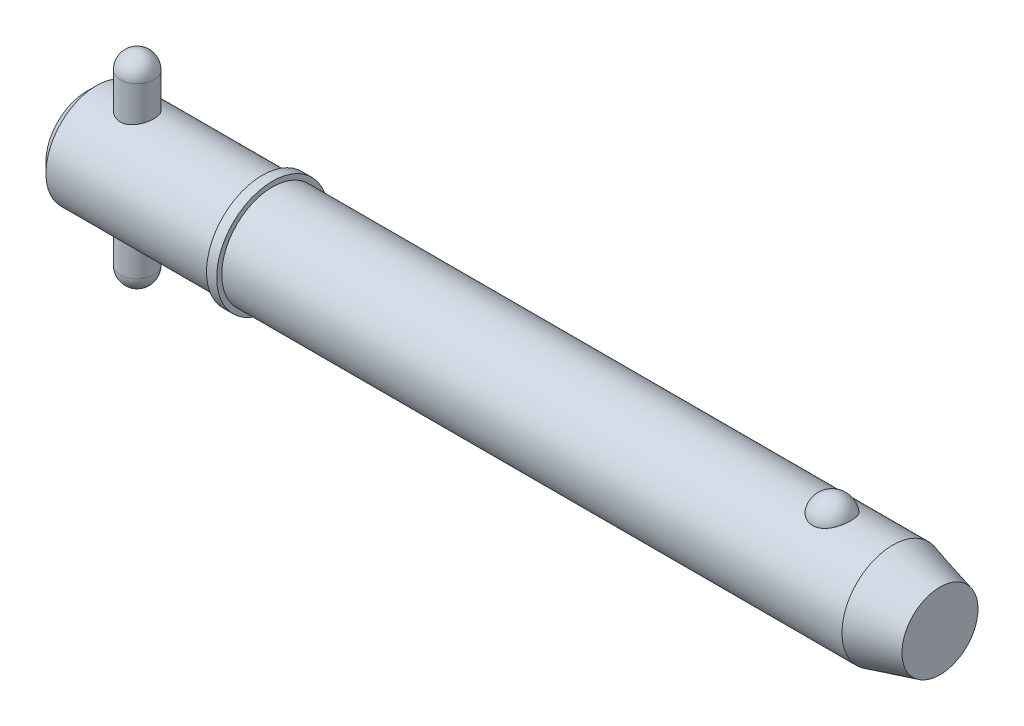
ISO-10303-21;
HEADER;
FILE_DESCRIPTION(('STEP AP214'),'2;1');
FILE_NAME('part.step','',(''),(''),'','','');
FILE_SCHEMA(('AUTOMOTIVE_DESIGN { 1 0 10303 214 1 1 1 1 }'));
ENDSEC;
DATA;
#1=APPLICATION_CONTEXT('core data for automotive mechanical design processes');
#2=APPLICATION_PROTOCOL_DEFINITION('international standard','automotive_design',2000,#1);
#3=PRODUCT_CONTEXT('',#1,'mechanical');
#4=PRODUCT('Part','Part','',(#3));
#5=PRODUCT_RELATED_PRODUCT_CATEGORY('part','',(#4));
#6=PRODUCT_DEFINITION_FORMATION('','',#4);
#7=PRODUCT_DEFINITION_CONTEXT('part definition',#1,'design');
#8=PRODUCT_DEFINITION('design','',#6,#7);
#9=PRODUCT_DEFINITION_SHAPE('','',#8);
#10=(LENGTH_UNIT() NAMED_UNIT(*) SI_UNIT(.MILLI.,.METRE.));
#11=(NAMED_UNIT(*) PLANE_ANGLE_UNIT() SI_UNIT($,.RADIAN.));
#12=(NAMED_UNIT(*) SI_UNIT($,.STERADIAN.) SOLID_ANGLE_UNIT());
#13=UNCERTAINTY_MEASURE_WITH_UNIT(LENGTH_MEASURE(1.E-05),#10,'distance_accuracy_value','');
#14=(GEOMETRIC_REPRESENTATION_CONTEXT(3) GLOBAL_UNCERTAINTY_ASSIGNED_CONTEXT((#13)) GLOBAL_UNIT_ASSIGNED_CONTEXT((#10,
#11,#12)) REPRESENTATION_CONTEXT('',''));
#15=CARTESIAN_POINT('',(0.,0.,0.));
#16=DIRECTION('',(0.,0.,1.));
#17=DIRECTION('',(1.,0.,0.));
#18=AXIS2_PLACEMENT_3D('',#15,#16,#17);
#19=CARTESIAN_POINT('',(9.525,19.05,0.));
#20=DIRECTION('',(0.,-1.,0.));
#21=DIRECTION('',(0.,0.,-1.));
#22=AXIS2_PLACEMENT_3D('',#19,#20,#21);
#23=CYLINDRICAL_SURFACE('',#22,3.175);
#24=CARTESIAN_POINT('',(9.525,-15.875,0.));
#25=DIRECTION('',(0.,-1.,0.));
#26=DIRECTION('',(0.,0.,-1.));
#27=AXIS2_PLACEMENT_3D('',#24,#25,#26);
#28=CIRCLE('',#27,3.175);
#29=CARTESIAN_POINT('',(9.525,-15.875,-3.175));
#30=VERTEX_POINT('',#29);
#31=EDGE_CURVE('P0_E10',#30,#30,#28,.F.);
#32=CARTESIAN_POINT('',(9.525,15.875,0.));
#33=DIRECTION('',(0.,-1.,0.));
#34=DIRECTION('',(0.,0.,-1.));
#35=AXIS2_PLACEMENT_3D('',#32,#33,#34);
#36=CIRCLE('',#35,3.175);
#37=CARTESIAN_POINT('',(9.525,15.875,-3.175));
#38=VERTEX_POINT('',#37);
#39=EDGE_CURVE('P0_E21',#38,#38,#36,.T.);
#40=CARTESIAN_POINT('',(9.525,-15.875,-3.175));
#41=CARTESIAN_POINT('',(9.525,-15.5442708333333,-3.175));
#42=CARTESIAN_POINT('',(9.525,-15.2135416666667,-3.175));
#43=CARTESIAN_POINT('',(9.525,-14.5520833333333,-3.175));
#44=CARTESIAN_POINT('',(9.525,-14.2213541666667,-3.175));
#45=CARTESIAN_POINT('',(9.525,-13.5598958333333,-3.175));
#46=CARTESIAN_POINT('',(9.525,-13.2291666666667,-3.175));
#47=CARTESIAN_POINT('',(9.525,-12.5677083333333,-3.175));
#48=CARTESIAN_POINT('',(9.525,-12.2369791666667,-3.175));
#49=CARTESIAN_POINT('',(9.525,-11.5755208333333,-3.175));
#50=CARTESIAN_POINT('',(9.525,-11.2447916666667,-3.175));
#51=CARTESIAN_POINT('',(9.525,-10.5833333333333,-3.175));
#52=CARTESIAN_POINT('',(9.525,-10.2526041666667,-3.175));
#53=CARTESIAN_POINT('',(9.525,-9.59114583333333,-3.175));
#54=CARTESIAN_POINT('',(9.525,-9.26041666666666,-3.175));
#55=CARTESIAN_POINT('',(9.525,-8.59895833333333,-3.175));
#56=CARTESIAN_POINT('',(9.525,-8.26822916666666,-3.175));
#57=CARTESIAN_POINT('',(9.525,-7.60677083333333,-3.175));
#58=CARTESIAN_POINT('',(9.525,-7.27604166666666,-3.175));
#59=CARTESIAN_POINT('',(9.525,-6.61458333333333,-3.175));
#60=CARTESIAN_POINT('',(9.525,-6.28385416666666,-3.175));
#61=CARTESIAN_POINT('',(9.525,-5.62239583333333,-3.175));
#62=CARTESIAN_POINT('',(9.525,-5.29166666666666,-3.175));
#63=CARTESIAN_POINT('',(9.525,-4.63020833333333,-3.175));
#64=CARTESIAN_POINT('',(9.525,-4.29947916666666,-3.175));
#65=CARTESIAN_POINT('',(9.525,-3.63802083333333,-3.175));
#66=CARTESIAN_POINT('',(9.525,-3.30729166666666,-3.175));
#67=CARTESIAN_POINT('',(9.525,-2.64583333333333,-3.175));
#68=CARTESIAN_POINT('',(9.525,-2.31510416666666,-3.175));
#69=CARTESIAN_POINT('',(9.525,-1.65364583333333,-3.175));
#70=CARTESIAN_POINT('',(9.525,-1.32291666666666,-3.175));
#71=CARTESIAN_POINT('',(9.525,-0.661458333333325,-3.175));
#72=CARTESIAN_POINT('',(9.525,-0.330729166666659,-3.175));
#73=CARTESIAN_POINT('',(9.525,0.330729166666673,-3.175));
#74=CARTESIAN_POINT('',(9.525,0.661458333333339,-3.175));
#75=CARTESIAN_POINT('',(9.525,1.32291666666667,-3.175));
#76=CARTESIAN_POINT('',(9.525,1.65364583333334,-3.175));
#77=CARTESIAN_POINT('',(9.525,2.31510416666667,-3.175));
#78=CARTESIAN_POINT('',(9.525,2.64583333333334,-3.175));
#79=CARTESIAN_POINT('',(9.525,3.30729166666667,-3.175));
#80=CARTESIAN_POINT('',(9.525,3.63802083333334,-3.175));
#81=CARTESIAN_POINT('',(9.525,4.29947916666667,-3.175));
#82=CARTESIAN_POINT('',(9.525,4.63020833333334,-3.175));
#83=CARTESIAN_POINT('',(9.525,5.29166666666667,-3.175));
#84=CARTESIAN_POINT('',(9.525,5.62239583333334,-3.175));
#85=CARTESIAN_POINT('',(9.525,6.28385416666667,-3.175));
#86=CARTESIAN_POINT('',(9.525,6.61458333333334,-3.175));
#87=CARTESIAN_POINT('',(9.525,7.27604166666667,-3.175));
#88=CARTESIAN_POINT('',(9.525,7.60677083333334,-3.175));
#89=CARTESIAN_POINT('',(9.525,8.26822916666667,-3.175));
#90=CARTESIAN_POINT('',(9.525,8.59895833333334,-3.175));
#91=CARTESIAN_POINT('',(9.525,9.26041666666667,-3.175));
#92=CARTESIAN_POINT('',(9.525,9.59114583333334,-3.175));
#93=CARTESIAN_POINT('',(9.525,10.2526041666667,-3.175));
#94=CARTESIAN_POINT('',(9.525,10.5833333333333,-3.175));
#95=CARTESIAN_POINT('',(9.525,11.2447916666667,-3.175));
#96=CARTESIAN_POINT('',(9.525,11.5755208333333,-3.175));
#97=CARTESIAN_POINT('',(9.525,12.2369791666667,-3.175));
#98=CARTESIAN_POINT('',(9.525,12.5677083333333,-3.175));
#99=CARTESIAN_POINT('',(9.525,13.2291666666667,-3.175));
#100=CARTESIAN_POINT('',(9.525,13.5598958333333,-3.175));
#101=CARTESIAN_POINT('',(9.525,14.2213541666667,-3.175));
#102=CARTESIAN_POINT('',(9.525,14.5520833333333,-3.175));
#103=CARTESIAN_POINT('',(9.525,15.2135416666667,-3.175));
#104=CARTESIAN_POINT('',(9.525,15.5442708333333,-3.175));
#105=CARTESIAN_POINT('',(9.525,15.875,-3.175));
#106=B_SPLINE_CURVE_WITH_KNOTS('',3,(#40,#41,#42,#43,#44,#45,#46,#47,#48,#49,#50,#51,#52,#53,
#54,#55,#56,#57,#58,#59,#60,#61,#62,#63,#64,#65,#66,#67,#68,#69,#70,#71,#72,#73,#74,#75,#76,#77,
#78,#79,#80,#81,#82,#83,#84,#85,#86,#87,#88,#89,#90,#91,#92,#93,#94,#95,#96,#97,#98,#99,#100,
#101,#102,#103,#104,#105),.UNSPECIFIED.,.F.,.F.,(4,2,2,2,2,2,2,2,2,2,2,2,2,2,2,2,2,2,2,2,2,2,2,
2,2,2,2,2,2,2,2,2,4),(0.,0.992187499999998,1.984375,2.9765625,3.96875,4.96093749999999,5.953125,
6.9453125,7.9375,8.92968749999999,9.921875,10.9140625,11.90625,12.8984375,13.890625,14.8828125,
15.875,16.8671875,17.859375,18.8515625,19.84375,20.8359375,21.828125,22.8203125,23.8125,
24.8046875,25.796875,26.7890625,27.78125,28.7734375,29.765625,30.7578125,31.75),.UNSPECIFIED.);
#107=EDGE_CURVE('P0_BSEAM14',#30,#38,#106,.T.);
#108=ORIENTED_EDGE('',*,*,#31,.T.);
#109=ORIENTED_EDGE('',*,*,#39,.T.);
#110=ORIENTED_EDGE('',*,*,#107,.T.);
#111=ORIENTED_EDGE('',*,*,#107,.F.);
#112=EDGE_LOOP('',(#108,#110,#109,#111));
#113=FACE_BOUND('',#112,.T.);
#114=ADVANCED_FACE('P0_F14',(#113),#23,.T.);
#115=CARTESIAN_POINT('',(9.525,-15.875,0.));
#116=DIRECTION('',(0.,0.,1.));
#117=DIRECTION('',(1.,0.,0.));
#118=AXIS2_PLACEMENT_3D('',#115,#116,#117);
#119=SPHERICAL_SURFACE('',#118,3.175);
#120=CARTESIAN_POINT('',(9.525,-15.875,0.));
#121=DIRECTION('',(0.,-1.,0.));
#122=DIRECTION('',(0.,0.,-1.));
#123=AXIS2_PLACEMENT_3D('',#120,#121,#122);
#124=SPHERICAL_SURFACE('',#123,3.175);
#125=ORIENTED_EDGE('',*,*,#31,.F.);
#126=EDGE_LOOP('',(#125));
#127=FACE_BOUND('',#126,.T.);
#128=ADVANCED_FACE('P0_F29',(#127),#124,.T.);
#129=CARTESIAN_POINT('',(9.525,15.875,0.));
#130=DIRECTION('',(0.,0.,1.));
#131=DIRECTION('',(1.,0.,0.));
#132=AXIS2_PLACEMENT_3D('',#129,#130,#131);
#133=SPHERICAL_SURFACE('',#132,3.175);
#134=CARTESIAN_POINT('',(9.525,15.875,0.));
#135=DIRECTION('',(0.,-1.,0.));
#136=DIRECTION('',(0.,0.,-1.));
#137=AXIS2_PLACEMENT_3D('',#134,#135,#136);
#138=SPHERICAL_SURFACE('',#137,3.175);
#139=ORIENTED_EDGE('',*,*,#39,.F.);
#140=EDGE_LOOP('',(#139));
#141=FACE_BOUND('',#140,.T.);
#142=ADVANCED_FACE('P0_F16',(#141),#138,.T.);
#143=CLOSED_SHELL('',(#114,#128,#142));
#144=MANIFOLD_SOLID_BREP('P0_B1',#143);
#145=CARTESIAN_POINT('',(0.,0.,0.));
#146=DIRECTION('',(1.,0.,0.));
#147=DIRECTION('',(0.,0.,-1.));
#148=AXIS2_PLACEMENT_3D('',#145,#146,#147);
#149=CYLINDRICAL_SURFACE('',#148,9.525);
#150=CARTESIAN_POINT('',(151.443054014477,0.,0.));
#151=DIRECTION('',(1.,0.,0.));
#152=DIRECTION('',(0.,0.,-1.));
#153=AXIS2_PLACEMENT_3D('',#150,#151,#152);
#154=CIRCLE('',#153,9.525);
#155=CARTESIAN_POINT('',(151.443054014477,0.,-9.525));
#156=VERTEX_POINT('',#155);
#157=EDGE_CURVE('P1_E81',#156,#156,#154,.T.);
#158=ORIENTED_EDGE('',*,*,#157,.F.);
#159=EDGE_LOOP('',(#158));
#160=FACE_BOUND('',#159,.T.);
#161=CARTESIAN_POINT('',(34.93,0.,0.));
#162=DIRECTION('',(1.,0.,0.));
#163=DIRECTION('',(0.,0.,-1.));
#164=AXIS2_PLACEMENT_3D('',#161,#162,#163);
#165=CIRCLE('',#164,9.525);
#166=CARTESIAN_POINT('',(34.93,0.,-9.525));
#167=VERTEX_POINT('',#166);
#168=EDGE_CURVE('P1_E85',#167,#167,#165,.T.);
#169=ORIENTED_EDGE('',*,*,#168,.T.);
#170=EDGE_LOOP('',(#169));
#171=FACE_BOUND('',#170,.T.);
#172=CARTESIAN_POINT('',(140.045757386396,8.80405803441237,3.63513233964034));
#173=CARTESIAN_POINT('',(139.951676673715,8.80405953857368,3.63513053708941));
#174=CARTESIAN_POINT('',(139.857561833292,8.80561325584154,3.63137461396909));
#175=CARTESIAN_POINT('',(139.670012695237,8.81177748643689,3.61638665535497));
#176=CARTESIAN_POINT('',(139.576578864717,8.81638992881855,3.60514990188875));
#177=CARTESIAN_POINT('',(139.297945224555,8.83467114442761,3.56024627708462));
#178=CARTESIAN_POINT('',(139.114691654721,8.85278327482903,3.51538626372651));
#179=CARTESIAN_POINT('',(138.759509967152,8.89871214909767,3.39742145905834));
#180=CARTESIAN_POINT('',(138.587553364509,8.92650327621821,3.32439116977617));
#181=CARTESIAN_POINT('',(138.258707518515,8.98874819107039,3.15220244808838));
#182=CARTESIAN_POINT('',(138.101811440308,9.02319893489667,3.05305594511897));
#183=CARTESIAN_POINT('',(137.802214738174,9.09629186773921,2.82797815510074));
#184=CARTESIAN_POINT('',(137.660060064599,9.13502685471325,2.70135138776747));
#185=CARTESIAN_POINT('',(137.398299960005,9.21186572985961,2.42641932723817));
#186=CARTESIAN_POINT('',(137.278701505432,9.24996941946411,2.2781073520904));
#187=CARTESIAN_POINT('',(137.059645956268,9.32341082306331,1.95652290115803));
#188=CARTESIAN_POINT('',(136.961317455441,9.35855090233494,1.78243511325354));
#189=CARTESIAN_POINT('',(136.793819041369,9.42045142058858,1.41937246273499));
#190=CARTESIAN_POINT('',(136.724651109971,9.44721128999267,1.23039658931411));
#191=CARTESIAN_POINT('',(136.616199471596,9.48990641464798,0.84037088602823));
#192=CARTESIAN_POINT('',(136.577288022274,9.50570658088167,0.639202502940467));
#193=CARTESIAN_POINT('',(136.531555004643,9.52433146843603,0.232664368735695));
#194=CARTESIAN_POINT('',(136.524732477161,9.52715657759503,0.0272947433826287));
#195=CARTESIAN_POINT('',(136.543255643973,9.51956918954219,-0.380478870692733));
#196=CARTESIAN_POINT('',(136.568405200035,9.50923740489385,-0.582893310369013));
#197=CARTESIAN_POINT('',(136.65002537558,9.47651897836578,-0.98029399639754));
#198=CARTESIAN_POINT('',(136.706496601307,9.45413210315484,-1.17528009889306));
#199=CARTESIAN_POINT('',(136.849719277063,9.39954044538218,-1.55263697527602));
#200=CARTESIAN_POINT('',(136.936512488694,9.36732213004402,-1.73498993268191));
#201=CARTESIAN_POINT('',(137.138610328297,9.29640700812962,-2.08177763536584));
#202=CARTESIAN_POINT('',(137.253917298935,9.25770966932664,-2.24621090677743));
#203=CARTESIAN_POINT('',(137.511264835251,9.17775604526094,-2.5533833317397));
#204=CARTESIAN_POINT('',(137.653434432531,9.136488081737,-2.696011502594));
#205=CARTESIAN_POINT('',(137.96089985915,9.05620497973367,-2.95451229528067));
#206=CARTESIAN_POINT('',(138.126193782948,9.01718965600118,-3.07038711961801));
#207=CARTESIAN_POINT('',(138.472052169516,8.94680019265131,-3.26976836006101));
#208=CARTESIAN_POINT('',(138.652227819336,8.91528408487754,-3.35389750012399));
#209=CARTESIAN_POINT('',(139.025651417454,8.86272514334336,-3.49043503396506));
#210=CARTESIAN_POINT('',(139.218894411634,8.84167836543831,-3.54285537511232));
#211=CARTESIAN_POINT('',(139.602503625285,8.81348056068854,-3.61241306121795));
#212=CARTESIAN_POINT('',(139.792525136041,8.80568348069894,-3.6311933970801));
#213=CARTESIAN_POINT('',(140.173190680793,8.80289410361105,-3.63795342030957));
#214=CARTESIAN_POINT('',(140.363834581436,8.80789922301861,-3.62593932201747));
#215=CARTESIAN_POINT('',(140.734007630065,8.82974915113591,-3.57238430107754));
#216=CARTESIAN_POINT('',(140.913697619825,8.84621463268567,-3.53178890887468));
#217=CARTESIAN_POINT('',(141.263422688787,8.88875330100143,-3.42331083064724));
#218=CARTESIAN_POINT('',(141.433456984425,8.91482726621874,-3.35542593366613));
#219=CARTESIAN_POINT('',(141.763237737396,8.97448239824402,-3.19248225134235));
#220=CARTESIAN_POINT('',(141.922680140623,9.00821446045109,-3.0968647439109));
#221=CARTESIAN_POINT('',(142.223513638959,9.07935398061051,-2.88162736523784));
#222=CARTESIAN_POINT('',(142.364900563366,9.11676228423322,-2.76200196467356));
#223=CARTESIAN_POINT('',(142.63331931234,9.19347419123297,-2.49516285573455));
#224=CARTESIAN_POINT('',(142.759275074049,9.23277872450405,-2.34686614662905));
#225=CARTESIAN_POINT('',(142.985522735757,9.3073761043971,-2.03093683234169));
#226=CARTESIAN_POINT('',(143.08581004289,9.34266823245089,-1.86330077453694));
#227=CARTESIAN_POINT('',(143.261514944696,9.40674710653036,-1.50744893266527));
#228=CARTESIAN_POINT('',(143.336041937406,9.43529176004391,-1.31874876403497));
#229=CARTESIAN_POINT('',(143.45416505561,9.48144132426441,-0.930631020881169));
#230=CARTESIAN_POINT('',(143.497760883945,9.49904612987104,-0.731213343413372));
#231=CARTESIAN_POINT('',(143.553158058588,9.5215314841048,-0.327147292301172));
#232=CARTESIAN_POINT('',(143.564935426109,9.52640243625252,-0.122495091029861));
#233=CARTESIAN_POINT('',(143.556382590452,9.5228957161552,0.28601848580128));
#234=CARTESIAN_POINT('',(143.53605305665,9.5145183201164,0.489879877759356));
#235=CARTESIAN_POINT('',(143.463884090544,9.48544083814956,0.88999431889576));
#236=CARTESIAN_POINT('',(143.412199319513,9.46480124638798,1.08627971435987));
#237=CARTESIAN_POINT('',(143.278491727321,9.4133389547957,1.46682086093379));
#238=CARTESIAN_POINT('',(143.196466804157,9.38251554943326,1.65107577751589));
#239=CARTESIAN_POINT('',(143.00319292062,9.31365636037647,2.00346348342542));
#240=CARTESIAN_POINT('',(142.891783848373,9.27558138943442,2.17150083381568));
#241=CARTESIAN_POINT('',(142.642294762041,9.19638714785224,2.48563115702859));
#242=CARTESIAN_POINT('',(142.504216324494,9.15526805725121,2.63172542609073));
#243=CARTESIAN_POINT('',(142.204843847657,9.07465393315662,2.89750997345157));
#244=CARTESIAN_POINT('',(142.043610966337,9.03515496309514,3.01726776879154));
#245=CARTESIAN_POINT('',(141.701613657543,8.96227564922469,3.22732920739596));
#246=CARTESIAN_POINT('',(141.520841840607,8.92889763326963,3.31762165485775));
#247=CARTESIAN_POINT('',(141.151445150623,8.8734538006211,3.46314419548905));
#248=CARTESIAN_POINT('',(140.96332371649,8.85102983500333,3.51950082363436));
#249=CARTESIAN_POINT('',(140.67578699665,8.8266696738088,3.57993683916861));
#250=CARTESIAN_POINT('',(140.579133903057,8.82009725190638,3.5960621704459));
#251=CARTESIAN_POINT('',(140.384677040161,8.81020897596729,3.62022512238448));
#252=CARTESIAN_POINT('',(140.286874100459,8.80689090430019,3.62826825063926));
#253=CARTESIAN_POINT('',(140.141224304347,8.80445615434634,3.63416760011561));
#254=CARTESIAN_POINT('',(140.093495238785,8.80405727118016,3.63513325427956));
#255=CARTESIAN_POINT('',(140.045757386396,8.80405803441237,3.63513233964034));
#256=B_SPLINE_CURVE_WITH_KNOTS('',3,(#172,#173,#174,#175,#176,#177,#178,#179,#180,#181,#182,
#183,#184,#185,#186,#187,#188,#189,#190,#191,#192,#193,#194,#195,#196,#197,#198,#199,#200,#201,
#202,#203,#204,#205,#206,#207,#208,#209,#210,#211,#212,#213,#214,#215,#216,#217,#218,#219,#220,
#221,#222,#223,#224,#225,#226,#227,#228,#229,#230,#231,#232,#233,#234,#235,#236,#237,#238,#239,
#240,#241,#242,#243,#244,#245,#246,#247,#248,#249,#250,#251,#252,#253,#254,#255),.UNSPECIFIED.,
.T.,.F.,(4,2,2,2,2,2,2,2,2,2,2,2,2,2,2,2,2,2,2,2,2,2,2,2,2,2,2,2,2,2,2,2,2,2,2,2,2,2,2,2,2,4),
(0.,0.282202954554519,0.564584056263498,1.13017050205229,1.69427128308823,2.25811483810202,
2.83836627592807,3.41879688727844,4.02497117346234,4.63118665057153,5.24474754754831,
5.85829010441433,6.46808687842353,7.07789545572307,7.68854723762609,8.299249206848,
8.91296283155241,9.52662591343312,10.1275338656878,10.7282152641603,11.2986646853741,
11.8689989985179,12.4213015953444,12.973648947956,13.5380053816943,14.1024919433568,
14.695298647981,15.2882113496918,15.8999469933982,16.5116885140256,17.1238909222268,
17.7360805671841,18.3452748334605,18.9545113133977,19.567138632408,20.179729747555,
20.7907316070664,21.4019653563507,21.9915938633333,22.2859053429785,22.5800161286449,
22.7232098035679),.UNSPECIFIED.);
#257=CARTESIAN_POINT('',(140.045757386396,8.80405803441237,3.63513233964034));
#258=VERTEX_POINT('',#257);
#259=EDGE_CURVE('P1_E35',#258,#258,#256,.T.);
#260=ORIENTED_EDGE('',*,*,#259,.T.);
#261=EDGE_LOOP('',(#260));
#262=FACE_BOUND('',#261,.T.);
#263=ADVANCED_FACE('P1_F13',(#160,#171,#262),#149,.T.);
#264=CARTESIAN_POINT('',(0.,0.,0.));
#265=DIRECTION('',(-1.,0.,0.));
#266=DIRECTION('',(0.,0.,1.));
#267=AXIS2_PLACEMENT_3D('',#264,#265,#266);
#268=PLANE('',#267);
#269=CARTESIAN_POINT('',(0.,0.,0.));
#270=DIRECTION('',(1.,0.,0.));
#271=DIRECTION('',(0.,0.,-1.));
#272=AXIS2_PLACEMENT_3D('',#269,#270,#271);
#273=CIRCLE('',#272,7.62);
#274=CARTESIAN_POINT('',(0.,0.,-7.62));
#275=VERTEX_POINT('',#274);
#276=EDGE_CURVE('P1_E9',#275,#275,#273,.T.);
#277=ORIENTED_EDGE('',*,*,#276,.F.);
#278=EDGE_LOOP('',(#277));
#279=FACE_BOUND('',#278,.T.);
#280=ADVANCED_FACE('P1_F15',(#279),#268,.T.);
#281=CARTESIAN_POINT('',(1.90499999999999,0.,0.));
#282=DIRECTION('',(1.,0.,0.));
#283=DIRECTION('',(0.,0.,-1.));
#284=AXIS2_PLACEMENT_3D('',#281,#282,#283);
#285=CONICAL_SURFACE('',#284,9.525,0.785398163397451);
#286=ORIENTED_EDGE('',*,*,#276,.T.);
#287=EDGE_LOOP('',(#286));
#288=FACE_BOUND('',#287,.T.);
#289=CARTESIAN_POINT('',(1.90499999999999,0.,0.));
#290=DIRECTION('',(1.,0.,0.));
#291=DIRECTION('',(0.,0.,-1.));
#292=AXIS2_PLACEMENT_3D('',#289,#290,#291);
#293=CIRCLE('',#292,9.525);
#294=CARTESIAN_POINT('',(1.90499999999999,0.,-9.525));
#295=VERTEX_POINT('',#294);
#296=EDGE_CURVE('P1_E26',#295,#295,#293,.T.);
#297=ORIENTED_EDGE('',*,*,#296,.F.);
#298=EDGE_LOOP('',(#297));
#299=FACE_BOUND('',#298,.T.);
#300=ADVANCED_FACE('P1_F77',(#288,#299),#285,.T.);
#301=CARTESIAN_POINT('',(0.,0.,0.));
#302=DIRECTION('',(1.,0.,0.));
#303=DIRECTION('',(0.,0.,-1.));
#304=AXIS2_PLACEMENT_3D('',#301,#302,#303);
#305=CYLINDRICAL_SURFACE('',#304,9.525);
#306=CARTESIAN_POINT('',(9.525,-8.98025612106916,3.175));
#307=CARTESIAN_POINT('',(9.35206354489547,-8.98025555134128,3.17500081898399));
#308=CARTESIAN_POINT('',(9.17913201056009,-8.98530617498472,3.16082293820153));
#309=CARTESIAN_POINT('',(8.83839221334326,-9.00485797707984,3.10467734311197));
#310=CARTESIAN_POINT('',(8.67058479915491,-9.0193607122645,3.06270505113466));
#311=CARTESIAN_POINT('',(8.34508461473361,-9.05599546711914,2.95260866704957));
#312=CARTESIAN_POINT('',(8.18737272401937,-9.07811252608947,2.88453582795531));
#313=CARTESIAN_POINT('',(7.88555684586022,-9.12746212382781,2.72434567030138));
#314=CARTESIAN_POINT('',(7.74145587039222,-9.1546957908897,2.63222304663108));
#315=CARTESIAN_POINT('',(7.46531411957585,-9.21240503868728,2.42268738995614));
#316=CARTESIAN_POINT('',(7.33388351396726,-9.24296141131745,2.30449228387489));
#317=CARTESIAN_POINT('',(7.09229340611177,-9.30319020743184,2.0478358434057));
#318=CARTESIAN_POINT('',(6.98213731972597,-9.33286248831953,1.90937126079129));
#319=CARTESIAN_POINT('',(6.78345450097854,-9.38891527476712,1.61164431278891));
#320=CARTESIAN_POINT('',(6.69556709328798,-9.41518969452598,1.45193356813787));
#321=CARTESIAN_POINT('',(6.54814671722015,-9.46053437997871,1.11896913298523));
#322=CARTESIAN_POINT('',(6.48860610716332,-9.47960658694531,0.945719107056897));
#323=CARTESIAN_POINT('',(6.40163866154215,-9.50782564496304,0.596991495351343));
#324=CARTESIAN_POINT('',(6.373166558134,-9.5172947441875,0.421801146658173));
#325=CARTESIAN_POINT('',(6.3458207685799,-9.52638456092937,0.068890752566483));
#326=CARTESIAN_POINT('',(6.34693945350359,-9.52600781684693,-0.108828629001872));
#327=CARTESIAN_POINT('',(6.37808050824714,-9.51566675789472,-0.454353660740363));
#328=CARTESIAN_POINT('',(6.4069675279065,-9.50607905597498,-0.622274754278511));
#329=CARTESIAN_POINT('',(6.490947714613,-9.47886621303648,-0.950732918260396));
#330=CARTESIAN_POINT('',(6.54604265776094,-9.46124052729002,-1.11126948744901));
#331=CARTESIAN_POINT('',(6.68153768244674,-9.41945253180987,-1.42288410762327));
#332=CARTESIAN_POINT('',(6.76226085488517,-9.3952073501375,-1.57381010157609));
#333=CARTESIAN_POINT('',(6.94645456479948,-9.34270397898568,-1.86030973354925));
#334=CARTESIAN_POINT('',(7.04993142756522,-9.31444467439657,-1.99587908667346));
#335=CARTESIAN_POINT('',(7.28241619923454,-9.25532159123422,-2.2545702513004));
#336=CARTESIAN_POINT('',(7.4123967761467,-9.22439783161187,-2.37680549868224));
#337=CARTESIAN_POINT('',(7.69127470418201,-9.1645528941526,-2.5980302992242));
#338=CARTESIAN_POINT('',(7.84017496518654,-9.13563202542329,-2.6970162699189));
#339=CARTESIAN_POINT('',(8.15547526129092,-9.08273917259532,-2.87016016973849));
#340=CARTESIAN_POINT('',(8.32209451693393,-9.05884361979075,-2.94394402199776));
#341=CARTESIAN_POINT('',(8.66638917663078,-9.01959241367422,-3.06210713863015));
#342=CARTESIAN_POINT('',(8.84405991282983,-9.00423318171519,-3.10649872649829));
#343=CARTESIAN_POINT('',(9.19682677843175,-8.98460345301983,-3.16281207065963));
#344=CARTESIAN_POINT('',(9.37167742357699,-8.9798639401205,-3.17610837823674));
#345=CARTESIAN_POINT('',(9.72113927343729,-8.9806993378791,-3.17374726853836));
#346=CARTESIAN_POINT('',(9.89575051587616,-8.98627237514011,-3.15809511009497));
#347=CARTESIAN_POINT('',(10.2335233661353,-9.00663737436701,-3.09951644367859));
#348=CARTESIAN_POINT('',(10.3968722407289,-9.02110608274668,-3.05754530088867));
#349=CARTESIAN_POINT('',(10.7141759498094,-9.05727657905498,-2.94866651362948));
#350=CARTESIAN_POINT('',(10.8681291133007,-9.07897964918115,-2.88175444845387));
#351=CARTESIAN_POINT('',(11.1676828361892,-9.12802586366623,-2.72248103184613));
#352=CARTESIAN_POINT('',(11.3128635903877,-9.1555260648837,-2.62937980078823));
#353=CARTESIAN_POINT('',(11.5860387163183,-9.21276315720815,-2.42120937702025));
#354=CARTESIAN_POINT('',(11.7140280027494,-9.24250070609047,-2.30613370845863));
#355=CARTESIAN_POINT('',(11.9555513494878,-9.30259247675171,-2.05070616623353));
#356=CARTESIAN_POINT('',(12.0680936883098,-9.33290753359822,-1.90940458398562));
#357=CARTESIAN_POINT('',(12.267933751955,-9.3893275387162,-1.60917665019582));
#358=CARTESIAN_POINT('',(12.3552323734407,-9.41543263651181,-1.45025092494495));
#359=CARTESIAN_POINT('',(12.5013088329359,-9.46036988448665,-1.12007606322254));
#360=CARTESIAN_POINT('',(12.5602723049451,-9.47924920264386,-0.9489158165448));
#361=CARTESIAN_POINT('',(12.6483355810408,-9.50781089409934,-0.598355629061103));
#362=CARTESIAN_POINT('',(12.6774461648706,-9.5174965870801,-0.4189586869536));
#363=CARTESIAN_POINT('',(12.7040070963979,-9.52632915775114,-0.066088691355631));
#364=CARTESIAN_POINT('',(12.7028811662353,-9.52594996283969,0.107266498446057));
#365=CARTESIAN_POINT('',(12.6725130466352,-9.51586223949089,0.451202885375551));
#366=CARTESIAN_POINT('',(12.643273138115,-9.50615446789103,0.621784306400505));
#367=CARTESIAN_POINT('',(12.5584514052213,-9.47867404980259,0.952633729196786));
#368=CARTESIAN_POINT('',(12.5032953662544,-9.46103195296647,1.1130225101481));
#369=CARTESIAN_POINT('',(12.3686013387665,-9.41949985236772,1.42233126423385));
#370=CARTESIAN_POINT('',(12.2890589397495,-9.39560871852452,1.57124915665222));
#371=CARTESIAN_POINT('',(12.1044667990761,-9.34294133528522,1.85938800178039));
#372=CARTESIAN_POINT('',(11.9985831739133,-9.31401720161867,1.9980473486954));
#373=CARTESIAN_POINT('',(11.7657327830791,-9.25490239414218,2.25609475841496));
#374=CARTESIAN_POINT('',(11.6387592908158,-9.22471131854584,2.37547664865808));
#375=CARTESIAN_POINT('',(11.3613902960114,-9.16505913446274,2.59633024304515));
#376=CARTESIAN_POINT('',(11.2102725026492,-9.13567286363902,2.69691791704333));
#377=CARTESIAN_POINT('',(10.8923631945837,-9.08241113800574,2.87119803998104));
#378=CARTESIAN_POINT('',(10.7255757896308,-9.05853424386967,2.94489751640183));
#379=CARTESIAN_POINT('',(10.3887212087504,-9.02021736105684,3.06020415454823));
#380=CARTESIAN_POINT('',(10.219143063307,-9.00539959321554,3.10311136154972));
#381=CARTESIAN_POINT('',(9.87470703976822,-8.98542092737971,3.16050396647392));
#382=CARTESIAN_POINT('',(9.699851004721,-8.98025669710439,3.17499917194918));
#383=CARTESIAN_POINT('',(9.525,-8.98025612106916,3.175));
#384=B_SPLINE_CURVE_WITH_KNOTS('',3,(#306,#307,#308,#309,#310,#311,#312,#313,#314,#315,#316,
#317,#318,#319,#320,#321,#322,#323,#324,#325,#326,#327,#328,#329,#330,#331,#332,#333,#334,#335,
#336,#337,#338,#339,#340,#341,#342,#343,#344,#345,#346,#347,#348,#349,#350,#351,#352,#353,#354,
#355,#356,#357,#358,#359,#360,#361,#362,#363,#364,#365,#366,#367,#368,#369,#370,#371,#372,#373,
#374,#375,#376,#377,#378,#379,#380,#381,#382,#383),.UNSPECIFIED.,.T.,.F.,(4,2,2,2,2,2,2,2,2,2,2,
2,2,2,2,2,2,2,2,2,2,2,2,2,2,2,2,2,2,2,2,2,2,2,2,2,2,2,4),(0.,0.518161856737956,1.03640907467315,
1.55364379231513,2.07099270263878,2.60671746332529,3.14252816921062,3.69231882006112,
4.24196117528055,4.77247962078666,5.30286129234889,5.81244090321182,6.32205505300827,
6.83836754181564,7.3548237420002,7.89559553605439,8.43645060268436,8.98501631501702,
9.53335188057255,10.056948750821,10.5804505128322,11.0859695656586,11.5915782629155,
12.1132237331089,12.6350231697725,13.1819271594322,13.7288117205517,14.2720628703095,
14.815117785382,15.3326491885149,15.8501386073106,16.3594083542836,16.868770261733,
17.3969527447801,17.925304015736,18.4743376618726,19.023227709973,19.5473069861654,
20.0712053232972),.UNSPECIFIED.);
#385=CARTESIAN_POINT('',(9.525,-8.98025612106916,3.175));
#386=VERTEX_POINT('',#385);
#387=EDGE_CURVE('P1_E17',#386,#386,#384,.T.);
#388=ORIENTED_EDGE('',*,*,#387,.F.);
#389=EDGE_LOOP('',(#388));
#390=FACE_BOUND('',#389,.T.);
#391=CARTESIAN_POINT('',(9.525,8.98025612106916,3.175));
#392=CARTESIAN_POINT('',(9.69793645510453,8.98025555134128,3.17500081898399));
#393=CARTESIAN_POINT('',(9.87086798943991,8.98530617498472,3.16082293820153));
#394=CARTESIAN_POINT('',(10.2116077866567,9.00485797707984,3.10467734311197));
#395=CARTESIAN_POINT('',(10.3794152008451,9.0193607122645,3.06270505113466));
#396=CARTESIAN_POINT('',(10.7049153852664,9.05599546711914,2.95260866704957));
#397=CARTESIAN_POINT('',(10.8626272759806,9.07811252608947,2.88453582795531));
#398=CARTESIAN_POINT('',(11.1644431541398,9.12746212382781,2.72434567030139));
#399=CARTESIAN_POINT('',(11.3085441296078,9.15469579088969,2.63222304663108));
#400=CARTESIAN_POINT('',(11.5846858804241,9.21240503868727,2.42268738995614));
#401=CARTESIAN_POINT('',(11.7161164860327,9.24296141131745,2.30449228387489));
#402=CARTESIAN_POINT('',(11.9577065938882,9.30319020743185,2.0478358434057));
#403=CARTESIAN_POINT('',(12.067862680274,9.33286248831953,1.90937126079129));
#404=CARTESIAN_POINT('',(12.2665454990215,9.38891527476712,1.61164431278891));
#405=CARTESIAN_POINT('',(12.354432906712,9.41518969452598,1.45193356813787));
#406=CARTESIAN_POINT('',(12.5018532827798,9.46053437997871,1.11896913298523));
#407=CARTESIAN_POINT('',(12.5613938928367,9.47960658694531,0.945719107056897));
#408=CARTESIAN_POINT('',(12.6483613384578,9.50782564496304,0.596991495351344));
#409=CARTESIAN_POINT('',(12.676833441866,9.5172947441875,0.421801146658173));
#410=CARTESIAN_POINT('',(12.7041792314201,9.52638456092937,0.0688907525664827));
#411=CARTESIAN_POINT('',(12.7030605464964,9.52600781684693,-0.108828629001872));
#412=CARTESIAN_POINT('',(12.6719194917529,9.51566675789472,-0.454353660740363));
#413=CARTESIAN_POINT('',(12.6430324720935,9.50607905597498,-0.622274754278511));
#414=CARTESIAN_POINT('',(12.559052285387,9.47886621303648,-0.950732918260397));
#415=CARTESIAN_POINT('',(12.5039573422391,9.46124052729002,-1.11126948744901));
#416=CARTESIAN_POINT('',(12.3684623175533,9.41945253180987,-1.42288410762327));
#417=CARTESIAN_POINT('',(12.2877391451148,9.3952073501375,-1.57381010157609));
#418=CARTESIAN_POINT('',(12.1035454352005,9.34270397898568,-1.86030973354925));
#419=CARTESIAN_POINT('',(12.0000685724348,9.31444467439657,-1.99587908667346));
#420=CARTESIAN_POINT('',(11.7675838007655,9.25532159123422,-2.2545702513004));
#421=CARTESIAN_POINT('',(11.6376032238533,9.22439783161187,-2.37680549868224));
#422=CARTESIAN_POINT('',(11.358725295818,9.1645528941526,-2.5980302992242));
#423=CARTESIAN_POINT('',(11.2098250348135,9.13563202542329,-2.6970162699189));
#424=CARTESIAN_POINT('',(10.8945247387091,9.08273917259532,-2.87016016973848));
#425=CARTESIAN_POINT('',(10.7279054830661,9.05884361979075,-2.94394402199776));
#426=CARTESIAN_POINT('',(10.3836108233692,9.01959241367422,-3.06210713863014));
#427=CARTESIAN_POINT('',(10.2059400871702,9.00423318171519,-3.10649872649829));
#428=CARTESIAN_POINT('',(9.85317322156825,8.98460345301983,-3.16281207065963));
#429=CARTESIAN_POINT('',(9.67832257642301,8.9798639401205,-3.17610837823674));
#430=CARTESIAN_POINT('',(9.32886072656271,8.9806993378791,-3.17374726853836));
#431=CARTESIAN_POINT('',(9.15424948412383,8.98627237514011,-3.15809511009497));
#432=CARTESIAN_POINT('',(8.81647663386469,9.00663737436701,-3.09951644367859));
#433=CARTESIAN_POINT('',(8.65312775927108,9.02110608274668,-3.05754530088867));
#434=CARTESIAN_POINT('',(8.33582405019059,9.05727657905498,-2.94866651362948));
#435=CARTESIAN_POINT('',(8.18187088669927,9.07897964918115,-2.88175444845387));
#436=CARTESIAN_POINT('',(7.88231716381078,9.12802586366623,-2.72248103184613));
#437=CARTESIAN_POINT('',(7.73713640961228,9.1555260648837,-2.62937980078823));
#438=CARTESIAN_POINT('',(7.46396128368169,9.21276315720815,-2.42120937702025));
#439=CARTESIAN_POINT('',(7.33597199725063,9.24250070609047,-2.30613370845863));
#440=CARTESIAN_POINT('',(7.09444865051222,9.30259247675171,-2.05070616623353));
#441=CARTESIAN_POINT('',(6.98190631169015,9.33290753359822,-1.90940458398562));
#442=CARTESIAN_POINT('',(6.78206624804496,9.3893275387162,-1.60917665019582));
#443=CARTESIAN_POINT('',(6.6947676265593,9.41543263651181,-1.45025092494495));
#444=CARTESIAN_POINT('',(6.54869116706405,9.46036988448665,-1.12007606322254));
#445=CARTESIAN_POINT('',(6.48972769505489,9.47924920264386,-0.948915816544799));
#446=CARTESIAN_POINT('',(6.40166441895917,9.50781089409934,-0.598355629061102));
#447=CARTESIAN_POINT('',(6.3725538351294,9.5174965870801,-0.418958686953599));
#448=CARTESIAN_POINT('',(6.34599290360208,9.52632915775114,-0.0660886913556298));
#449=CARTESIAN_POINT('',(6.3471188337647,9.52594996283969,0.107266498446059));
#450=CARTESIAN_POINT('',(6.37748695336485,9.51586223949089,0.451202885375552));
#451=CARTESIAN_POINT('',(6.40672686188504,9.50615446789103,0.621784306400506));
#452=CARTESIAN_POINT('',(6.49154859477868,9.47867404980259,0.952633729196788));
#453=CARTESIAN_POINT('',(6.54670463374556,9.46103195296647,1.11302251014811));
#454=CARTESIAN_POINT('',(6.68139866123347,9.41949985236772,1.42233126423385));
#455=CARTESIAN_POINT('',(6.76094106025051,9.39560871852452,1.57124915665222));
#456=CARTESIAN_POINT('',(6.94553320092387,9.34294133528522,1.85938800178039));
#457=CARTESIAN_POINT('',(7.05141682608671,9.31401720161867,1.9980473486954));
#458=CARTESIAN_POINT('',(7.28426721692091,9.25490239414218,2.25609475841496));
#459=CARTESIAN_POINT('',(7.41124070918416,9.22471131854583,2.37547664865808));
#460=CARTESIAN_POINT('',(7.68860970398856,9.16505913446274,2.59633024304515));
#461=CARTESIAN_POINT('',(7.83972749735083,9.13567286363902,2.69691791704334));
#462=CARTESIAN_POINT('',(8.15763680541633,9.08241113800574,2.87119803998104));
#463=CARTESIAN_POINT('',(8.32442421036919,9.05853424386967,2.94489751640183));
#464=CARTESIAN_POINT('',(8.66127879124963,9.02021736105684,3.06020415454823));
#465=CARTESIAN_POINT('',(8.83085693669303,9.00539959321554,3.10311136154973));
#466=CARTESIAN_POINT('',(9.17529296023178,8.98542092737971,3.16050396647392));
#467=CARTESIAN_POINT('',(9.350148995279,8.98025669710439,3.17499917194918));
#468=CARTESIAN_POINT('',(9.525,8.98025612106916,3.175));
#469=B_SPLINE_CURVE_WITH_KNOTS('',3,(#391,#392,#393,#394,#395,#396,#397,#398,#399,#400,#401,
#402,#403,#404,#405,#406,#407,#408,#409,#410,#411,#412,#413,#414,#415,#416,#417,#418,#419,#420,
#421,#422,#423,#424,#425,#426,#427,#428,#429,#430,#431,#432,#433,#434,#435,#436,#437,#438,#439,
#440,#441,#442,#443,#444,#445,#446,#447,#448,#449,#450,#451,#452,#453,#454,#455,#456,#457,#458,
#459,#460,#461,#462,#463,#464,#465,#466,#467,#468),.UNSPECIFIED.,.T.,.F.,(4,2,2,2,2,2,2,2,2,2,2,
2,2,2,2,2,2,2,2,2,2,2,2,2,2,2,2,2,2,2,2,2,2,2,2,2,2,2,4),(0.,0.518161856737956,1.03640907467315,
1.55364379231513,2.07099270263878,2.60671746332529,3.14252816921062,3.69231882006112,
4.24196117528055,4.77247962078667,5.30286129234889,5.81244090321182,6.32205505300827,
6.83836754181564,7.3548237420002,7.89559553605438,8.43645060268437,8.98501631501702,
9.53335188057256,10.056948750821,10.5804505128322,11.0859695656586,11.5915782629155,
12.1132237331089,12.6350231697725,13.1819271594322,13.7288117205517,14.2720628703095,
14.815117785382,15.3326491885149,15.8501386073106,16.3594083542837,16.868770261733,
17.3969527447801,17.9253040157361,18.4743376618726,19.023227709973,19.5473069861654,
20.0712053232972),.UNSPECIFIED.);
#470=CARTESIAN_POINT('',(9.525,8.98025612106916,3.175));
#471=VERTEX_POINT('',#470);
#472=EDGE_CURVE('P1_E43',#471,#471,#469,.T.);
#473=ORIENTED_EDGE('',*,*,#472,.F.);
#474=EDGE_LOOP('',(#473));
#475=FACE_BOUND('',#474,.T.);
#476=ORIENTED_EDGE('',*,*,#296,.T.);
#477=EDGE_LOOP('',(#476));
#478=FACE_BOUND('',#477,.T.);
#479=CARTESIAN_POINT('',(33.025,0.,0.));
#480=DIRECTION('',(1.,0.,0.));
#481=DIRECTION('',(0.,0.,-1.));
#482=AXIS2_PLACEMENT_3D('',#479,#480,#481);
#483=CIRCLE('',#482,9.525);
#484=CARTESIAN_POINT('',(33.025,0.,-9.525));
#485=VERTEX_POINT('',#484);
#486=EDGE_CURVE('P1_E31',#485,#485,#483,.T.);
#487=ORIENTED_EDGE('',*,*,#486,.F.);
#488=EDGE_LOOP('',(#487));
#489=FACE_BOUND('',#488,.T.);
#490=ADVANCED_FACE('P1_F103',(#390,#475,#478,#489),#305,.T.);
#491=CARTESIAN_POINT('',(33.025,9.525,0.));
#492=DIRECTION('',(-1.,0.,0.));
#493=DIRECTION('',(0.,0.,1.));
#494=AXIS2_PLACEMENT_3D('',#491,#492,#493);
#495=PLANE('',#494);
#496=ORIENTED_EDGE('',*,*,#486,.T.);
#497=EDGE_LOOP('',(#496));
#498=FACE_BOUND('',#497,.T.);
#499=CARTESIAN_POINT('',(33.025,0.,0.));
#500=DIRECTION('',(1.,0.,0.));
#501=DIRECTION('',(0.,0.,-1.));
#502=AXIS2_PLACEMENT_3D('',#499,#500,#501);
#503=CIRCLE('',#502,10.4775);
#504=CARTESIAN_POINT('',(33.025,0.,-10.4775));
#505=VERTEX_POINT('',#504);
#506=EDGE_CURVE('P1_E91',#505,#505,#503,.T.);
#507=ORIENTED_EDGE('',*,*,#506,.F.);
#508=EDGE_LOOP('',(#507));
#509=FACE_BOUND('',#508,.T.);
#510=ADVANCED_FACE('P1_F100',(#498,#509),#495,.T.);
#511=CARTESIAN_POINT('',(0.,0.,0.));
#512=DIRECTION('',(1.,0.,0.));
#513=DIRECTION('',(0.,0.,-1.));
#514=AXIS2_PLACEMENT_3D('',#511,#512,#513);
#515=CYLINDRICAL_SURFACE('',#514,10.4775);
#516=ORIENTED_EDGE('',*,*,#506,.T.);
#517=EDGE_LOOP('',(#516));
#518=FACE_BOUND('',#517,.T.);
#519=CARTESIAN_POINT('',(34.93,0.,0.));
#520=DIRECTION('',(1.,0.,0.));
#521=DIRECTION('',(0.,0.,-1.));
#522=AXIS2_PLACEMENT_3D('',#519,#520,#521);
#523=CIRCLE('',#522,10.4775);
#524=CARTESIAN_POINT('',(34.93,0.,-10.4775));
#525=VERTEX_POINT('',#524);
#526=EDGE_CURVE('P1_E88',#525,#525,#523,.T.);
#527=ORIENTED_EDGE('',*,*,#526,.F.);
#528=EDGE_LOOP('',(#527));
#529=FACE_BOUND('',#528,.T.);
#530=ADVANCED_FACE('P1_F68',(#518,#529),#515,.T.);
#531=CARTESIAN_POINT('',(34.93,10.4775,0.));
#532=DIRECTION('',(1.,0.,0.));
#533=DIRECTION('',(0.,0.,-1.));
#534=AXIS2_PLACEMENT_3D('',#531,#532,#533);
#535=PLANE('',#534);
#536=ORIENTED_EDGE('',*,*,#526,.T.);
#537=EDGE_LOOP('',(#536));
#538=FACE_BOUND('',#537,.T.);
#539=ORIENTED_EDGE('',*,*,#168,.F.);
#540=EDGE_LOOP('',(#539));
#541=FACE_BOUND('',#540,.T.);
#542=ADVANCED_FACE('P1_F62',(#538,#541),#535,.T.);
#543=CARTESIAN_POINT('',(160.33,0.,0.));
#544=DIRECTION('',(-1.,0.,0.));
#545=DIRECTION('',(0.,0.,1.));
#546=AXIS2_PLACEMENT_3D('',#543,#544,#545);
#547=CONICAL_SURFACE('',#546,7.14375000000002,0.261799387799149);
#548=ORIENTED_EDGE('',*,*,#157,.T.);
#549=EDGE_LOOP('',(#548));
#550=FACE_BOUND('',#549,.T.);
#551=CARTESIAN_POINT('',(160.33,0.,0.));
#552=DIRECTION('',(1.,0.,0.));
#553=DIRECTION('',(0.,0.,-1.));
#554=AXIS2_PLACEMENT_3D('',#551,#552,#553);
#555=CIRCLE('',#554,7.14375000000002);
#556=CARTESIAN_POINT('',(160.33,0.,-7.14375000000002));
#557=VERTEX_POINT('',#556);
#558=EDGE_CURVE('P1_E42',#557,#557,#555,.T.);
#559=ORIENTED_EDGE('',*,*,#558,.F.);
#560=EDGE_LOOP('',(#559));
#561=FACE_BOUND('',#560,.T.);
#562=ADVANCED_FACE('P1_F59',(#550,#561),#547,.T.);
#563=CARTESIAN_POINT('',(160.33,7.14375000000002,0.));
#564=DIRECTION('',(1.,0.,0.));
#565=DIRECTION('',(0.,0.,-1.));
#566=AXIS2_PLACEMENT_3D('',#563,#564,#565);
#567=PLANE('',#566);
#568=ORIENTED_EDGE('',*,*,#558,.T.);
#569=EDGE_LOOP('',(#568));
#570=FACE_BOUND('',#569,.T.);
#571=ADVANCED_FACE('P1_F55',(#570),#567,.T.);
#572=CARTESIAN_POINT('',(140.045757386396,8.5725,0.));
#573=DIRECTION('',(-1.,0.,0.));
#574=DIRECTION('',(0.,1.,0.));
#575=AXIS2_PLACEMENT_3D('',#572,#573,#574);
#576=SPHERICAL_SURFACE('',#575,3.64249999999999);
#577=ORIENTED_EDGE('',*,*,#259,.F.);
#578=EDGE_LOOP('',(#577));
#579=FACE_BOUND('',#578,.T.);
#580=ADVANCED_FACE('P1_F50',(#579),#576,.T.);
#581=CARTESIAN_POINT('',(9.525,-10.4775,0.));
#582=DIRECTION('',(0.,1.,0.));
#583=DIRECTION('',(0.,0.,1.));
#584=AXIS2_PLACEMENT_3D('',#581,#582,#583);
#585=CYLINDRICAL_SURFACE('',#584,3.175);
#586=ORIENTED_EDGE('',*,*,#387,.T.);
#587=EDGE_LOOP('',(#586));
#588=FACE_BOUND('',#587,.T.);
#589=ORIENTED_EDGE('',*,*,#472,.T.);
#590=EDGE_LOOP('',(#589));
#591=FACE_BOUND('',#590,.T.);
#592=ADVANCED_FACE('P1_F54',(#588,#591),#585,.F.);
#593=CLOSED_SHELL('',(#263,#280,#300,#490,#510,#530,#542,#562,#571,#580,#592));
#594=MANIFOLD_SOLID_BREP('P1_B1',#593);
#595=ADVANCED_BREP_SHAPE_REPRESENTATION('',(#18,#144,#594),#14);
#596=SHAPE_DEFINITION_REPRESENTATION(#9,#595);
ENDSEC;
END-ISO-10303-21;
